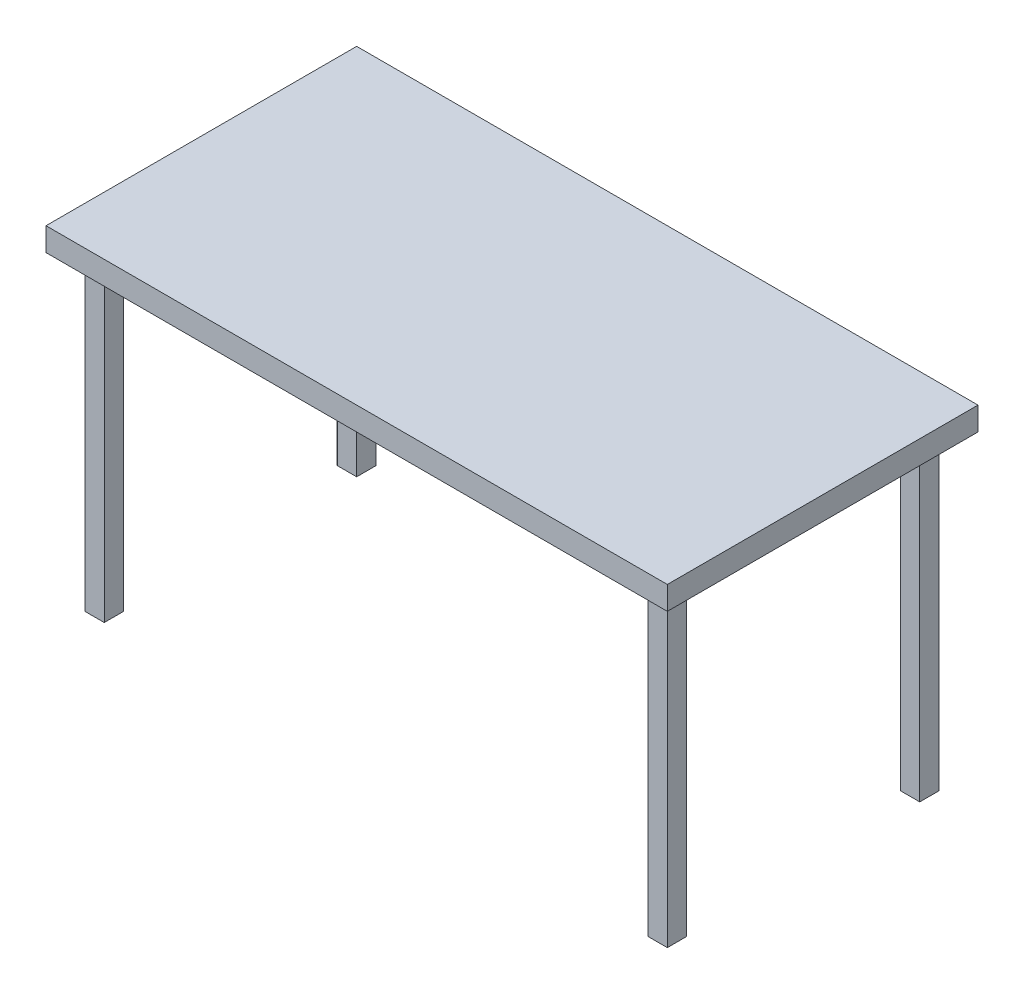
ISO-10303-21;
HEADER;
FILE_DESCRIPTION(('STEP AP214'),'2;1');
FILE_NAME('part.step','',(''),(''),'','','');
FILE_SCHEMA(('AUTOMOTIVE_DESIGN { 1 0 10303 214 1 1 1 1 }'));
ENDSEC;
DATA;
#1=APPLICATION_CONTEXT('core data for automotive mechanical design processes');
#2=APPLICATION_PROTOCOL_DEFINITION('international standard','automotive_design',2000,#1);
#3=PRODUCT_CONTEXT('',#1,'mechanical');
#4=PRODUCT('Part','Part','',(#3));
#5=PRODUCT_RELATED_PRODUCT_CATEGORY('part','',(#4));
#6=PRODUCT_DEFINITION_FORMATION('','',#4);
#7=PRODUCT_DEFINITION_CONTEXT('part definition',#1,'design');
#8=PRODUCT_DEFINITION('design','',#6,#7);
#9=PRODUCT_DEFINITION_SHAPE('','',#8);
#10=(LENGTH_UNIT() NAMED_UNIT(*) SI_UNIT(.MILLI.,.METRE.));
#11=(NAMED_UNIT(*) PLANE_ANGLE_UNIT() SI_UNIT($,.RADIAN.));
#12=(NAMED_UNIT(*) SI_UNIT($,.STERADIAN.) SOLID_ANGLE_UNIT());
#13=UNCERTAINTY_MEASURE_WITH_UNIT(LENGTH_MEASURE(1.E-05),#10,'distance_accuracy_value','');
#14=(GEOMETRIC_REPRESENTATION_CONTEXT(3) GLOBAL_UNCERTAINTY_ASSIGNED_CONTEXT((#13)) GLOBAL_UNIT_ASSIGNED_CONTEXT((#10,
#11,#12)) REPRESENTATION_CONTEXT('',''));
#15=CARTESIAN_POINT('',(0.,0.,0.));
#16=DIRECTION('',(0.,0.,1.));
#17=DIRECTION('',(1.,0.,0.));
#18=AXIS2_PLACEMENT_3D('',#15,#16,#17);
#19=CARTESIAN_POINT('',(0.,0.,0.));
#20=DIRECTION('',(0.,1.,0.));
#21=DIRECTION('',(0.,0.,1.));
#22=AXIS2_PLACEMENT_3D('',#19,#20,#21);
#23=PLANE('',#22);
#24=DIRECTION('',(1.,0.,0.));
#25=VECTOR('',#24,1.);
#26=CARTESIAN_POINT('',(-750.,0.,-300.));
#27=LINE('',#26,#25);
#28=CARTESIAN_POINT('',(-750.,0.,-300.));
#29=VERTEX_POINT('',#28);
#30=CARTESIAN_POINT('',(-700.,0.,-300.));
#31=VERTEX_POINT('',#30);
#32=EDGE_CURVE('E202',#29,#31,#27,.T.);
#33=ORIENTED_EDGE('',*,*,#32,.T.);
#34=DIRECTION('',(0.,0.,-1.));
#35=VECTOR('',#34,1.);
#36=CARTESIAN_POINT('',(-700.,0.,-350.));
#37=LINE('',#36,#35);
#38=CARTESIAN_POINT('',(-700.,0.,-350.));
#39=VERTEX_POINT('',#38);
#40=EDGE_CURVE('E176',#31,#39,#37,.T.);
#41=ORIENTED_EDGE('',*,*,#40,.T.);
#42=DIRECTION('',(-1.,0.,0.));
#43=VECTOR('',#42,1.);
#44=CARTESIAN_POINT('',(-750.,0.,-350.));
#45=LINE('',#44,#43);
#46=CARTESIAN_POINT('',(-750.,0.,-350.));
#47=VERTEX_POINT('',#46);
#48=EDGE_CURVE('E192',#39,#47,#45,.T.);
#49=ORIENTED_EDGE('',*,*,#48,.T.);
#50=DIRECTION('',(0.,0.,1.));
#51=VECTOR('',#50,1.);
#52=CARTESIAN_POINT('',(-750.,0.,-350.));
#53=LINE('',#52,#51);
#54=EDGE_CURVE('E48',#47,#29,#53,.T.);
#55=ORIENTED_EDGE('',*,*,#54,.T.);
#56=EDGE_LOOP('',(#33,#41,#49,#55));
#57=FACE_BOUND('',#56,.T.);
#58=DIRECTION('',(0.,0.,1.));
#59=VECTOR('',#58,1.);
#60=CARTESIAN_POINT('',(-700.,0.,350.));
#61=LINE('',#60,#59);
#62=CARTESIAN_POINT('',(-700.,0.,300.));
#63=VERTEX_POINT('',#62);
#64=CARTESIAN_POINT('',(-700.,0.,350.));
#65=VERTEX_POINT('',#64);
#66=EDGE_CURVE('E273',#63,#65,#61,.T.);
#67=ORIENTED_EDGE('',*,*,#66,.F.);
#68=DIRECTION('',(1.,0.,0.));
#69=VECTOR('',#68,1.);
#70=CARTESIAN_POINT('',(-750.,0.,300.));
#71=LINE('',#70,#69);
#72=CARTESIAN_POINT('',(-750.,0.,300.));
#73=VERTEX_POINT('',#72);
#74=EDGE_CURVE('E278',#73,#63,#71,.T.);
#75=ORIENTED_EDGE('',*,*,#74,.F.);
#76=DIRECTION('',(0.,0.,-1.));
#77=VECTOR('',#76,1.);
#78=CARTESIAN_POINT('',(-750.,0.,350.));
#79=LINE('',#78,#77);
#80=CARTESIAN_POINT('',(-750.,0.,350.));
#81=VERTEX_POINT('',#80);
#82=EDGE_CURVE('E290',#81,#73,#79,.T.);
#83=ORIENTED_EDGE('',*,*,#82,.F.);
#84=DIRECTION('',(-1.,0.,0.));
#85=VECTOR('',#84,1.);
#86=CARTESIAN_POINT('',(-750.,0.,350.));
#87=LINE('',#86,#85);
#88=EDGE_CURVE('E287',#65,#81,#87,.T.);
#89=ORIENTED_EDGE('',*,*,#88,.F.);
#90=EDGE_LOOP('',(#67,#75,#83,#89));
#91=FACE_BOUND('',#90,.T.);
#92=DIRECTION('',(0.,0.,1.));
#93=VECTOR('',#92,1.);
#94=CARTESIAN_POINT('',(-800.,0.,400.));
#95=LINE('',#94,#93);
#96=CARTESIAN_POINT('',(-800.,0.,-400.));
#97=VERTEX_POINT('',#96);
#98=CARTESIAN_POINT('',(-800.,0.,400.));
#99=VERTEX_POINT('',#98);
#100=EDGE_CURVE('E306',#97,#99,#95,.T.);
#101=ORIENTED_EDGE('',*,*,#100,.F.);
#102=DIRECTION('',(-1.,0.,0.));
#103=VECTOR('',#102,1.);
#104=CARTESIAN_POINT('',(800.,0.,-400.));
#105=LINE('',#104,#103);
#106=CARTESIAN_POINT('',(800.,0.,-400.));
#107=VERTEX_POINT('',#106);
#108=EDGE_CURVE('E311',#107,#97,#105,.T.);
#109=ORIENTED_EDGE('',*,*,#108,.F.);
#110=DIRECTION('',(0.,0.,-1.));
#111=VECTOR('',#110,1.);
#112=CARTESIAN_POINT('',(800.,0.,400.));
#113=LINE('',#112,#111);
#114=CARTESIAN_POINT('',(800.,0.,400.));
#115=VERTEX_POINT('',#114);
#116=EDGE_CURVE('E322',#115,#107,#113,.T.);
#117=ORIENTED_EDGE('',*,*,#116,.F.);
#118=DIRECTION('',(1.,0.,0.));
#119=VECTOR('',#118,1.);
#120=CARTESIAN_POINT('',(800.,0.,400.));
#121=LINE('',#120,#119);
#122=EDGE_CURVE('E320',#99,#115,#121,.T.);
#123=ORIENTED_EDGE('',*,*,#122,.F.);
#124=EDGE_LOOP('',(#101,#109,#117,#123));
#125=FACE_BOUND('',#124,.T.);
#126=DIRECTION('',(-1.,0.,0.));
#127=VECTOR('',#126,1.);
#128=CARTESIAN_POINT('',(750.,0.,300.));
#129=LINE('',#128,#127);
#130=CARTESIAN_POINT('',(750.,0.,300.));
#131=VERTEX_POINT('',#130);
#132=CARTESIAN_POINT('',(700.,0.,300.));
#133=VERTEX_POINT('',#132);
#134=EDGE_CURVE('E257',#131,#133,#129,.T.);
#135=ORIENTED_EDGE('',*,*,#134,.T.);
#136=DIRECTION('',(0.,0.,1.));
#137=VECTOR('',#136,1.);
#138=CARTESIAN_POINT('',(700.,0.,350.));
#139=LINE('',#138,#137);
#140=CARTESIAN_POINT('',(700.,0.,350.));
#141=VERTEX_POINT('',#140);
#142=EDGE_CURVE('E240',#133,#141,#139,.T.);
#143=ORIENTED_EDGE('',*,*,#142,.T.);
#144=DIRECTION('',(1.,0.,0.));
#145=VECTOR('',#144,1.);
#146=CARTESIAN_POINT('',(750.,0.,350.));
#147=LINE('',#146,#145);
#148=CARTESIAN_POINT('',(750.,0.,350.));
#149=VERTEX_POINT('',#148);
#150=EDGE_CURVE('E245',#141,#149,#147,.T.);
#151=ORIENTED_EDGE('',*,*,#150,.T.);
#152=DIRECTION('',(0.,0.,-1.));
#153=VECTOR('',#152,1.);
#154=CARTESIAN_POINT('',(750.,0.,350.));
#155=LINE('',#154,#153);
#156=EDGE_CURVE('E260',#149,#131,#155,.T.);
#157=ORIENTED_EDGE('',*,*,#156,.T.);
#158=EDGE_LOOP('',(#135,#143,#151,#157));
#159=FACE_BOUND('',#158,.T.);
#160=DIRECTION('',(0.,0.,-1.));
#161=VECTOR('',#160,1.);
#162=CARTESIAN_POINT('',(700.,0.,-350.));
#163=LINE('',#162,#161);
#164=CARTESIAN_POINT('',(700.,0.,-300.));
#165=VERTEX_POINT('',#164);
#166=CARTESIAN_POINT('',(700.,0.,-350.));
#167=VERTEX_POINT('',#166);
#168=EDGE_CURVE('E181',#165,#167,#163,.T.);
#169=ORIENTED_EDGE('',*,*,#168,.F.);
#170=DIRECTION('',(-1.,0.,0.));
#171=VECTOR('',#170,1.);
#172=CARTESIAN_POINT('',(750.,0.,-300.));
#173=LINE('',#172,#171);
#174=CARTESIAN_POINT('',(750.,0.,-300.));
#175=VERTEX_POINT('',#174);
#176=EDGE_CURVE('E215',#175,#165,#173,.T.);
#177=ORIENTED_EDGE('',*,*,#176,.F.);
#178=DIRECTION('',(0.,0.,1.));
#179=VECTOR('',#178,1.);
#180=CARTESIAN_POINT('',(750.,0.,-350.));
#181=LINE('',#180,#179);
#182=CARTESIAN_POINT('',(750.,0.,-350.));
#183=VERTEX_POINT('',#182);
#184=EDGE_CURVE('E225',#183,#175,#181,.T.);
#185=ORIENTED_EDGE('',*,*,#184,.F.);
#186=DIRECTION('',(1.,0.,0.));
#187=VECTOR('',#186,1.);
#188=CARTESIAN_POINT('',(750.,0.,-350.));
#189=LINE('',#188,#187);
#190=EDGE_CURVE('E56',#167,#183,#189,.T.);
#191=ORIENTED_EDGE('',*,*,#190,.F.);
#192=EDGE_LOOP('',(#169,#177,#185,#191));
#193=FACE_BOUND('',#192,.T.);
#194=ADVANCED_FACE('F33',(#57,#91,#125,#159,#193),#23,.F.);
#195=CARTESIAN_POINT('',(-800.,60.,400.));
#196=DIRECTION('',(1.,0.,0.));
#197=DIRECTION('',(0.,0.,-1.));
#198=AXIS2_PLACEMENT_3D('',#195,#196,#197);
#199=PLANE('',#198);
#200=ORIENTED_EDGE('',*,*,#100,.T.);
#201=DIRECTION('',(0.,-1.,0.));
#202=VECTOR('',#201,1.);
#203=CARTESIAN_POINT('',(-800.,60.,400.));
#204=LINE('',#203,#202);
#205=CARTESIAN_POINT('',(-800.,60.,400.));
#206=VERTEX_POINT('',#205);
#207=EDGE_CURVE('E11',#206,#99,#204,.T.);
#208=ORIENTED_EDGE('',*,*,#207,.F.);
#209=DIRECTION('',(0.,0.,1.));
#210=VECTOR('',#209,1.);
#211=CARTESIAN_POINT('',(-800.,60.,400.));
#212=LINE('',#211,#210);
#213=CARTESIAN_POINT('',(-800.,60.,-400.));
#214=VERTEX_POINT('',#213);
#215=EDGE_CURVE('E307',#214,#206,#212,.T.);
#216=ORIENTED_EDGE('',*,*,#215,.F.);
#217=DIRECTION('',(0.,-1.,0.));
#218=VECTOR('',#217,1.);
#219=CARTESIAN_POINT('',(-800.,60.,-400.));
#220=LINE('',#219,#218);
#221=EDGE_CURVE('E317',#214,#97,#220,.T.);
#222=ORIENTED_EDGE('',*,*,#221,.T.);
#223=EDGE_LOOP('',(#200,#208,#216,#222));
#224=FACE_BOUND('',#223,.T.);
#225=ADVANCED_FACE('F35',(#224),#199,.F.);
#226=CARTESIAN_POINT('',(800.,60.,400.));
#227=DIRECTION('',(0.,0.,-1.));
#228=DIRECTION('',(-1.,0.,0.));
#229=AXIS2_PLACEMENT_3D('',#226,#227,#228);
#230=PLANE('',#229);
#231=ORIENTED_EDGE('',*,*,#122,.T.);
#232=DIRECTION('',(0.,-1.,0.));
#233=VECTOR('',#232,1.);
#234=CARTESIAN_POINT('',(800.,60.,400.));
#235=LINE('',#234,#233);
#236=CARTESIAN_POINT('',(800.,60.,400.));
#237=VERTEX_POINT('',#236);
#238=EDGE_CURVE('E41',#237,#115,#235,.T.);
#239=ORIENTED_EDGE('',*,*,#238,.F.);
#240=DIRECTION('',(1.,0.,0.));
#241=VECTOR('',#240,1.);
#242=CARTESIAN_POINT('',(800.,60.,400.));
#243=LINE('',#242,#241);
#244=EDGE_CURVE('E310',#206,#237,#243,.T.);
#245=ORIENTED_EDGE('',*,*,#244,.F.);
#246=ORIENTED_EDGE('',*,*,#207,.T.);
#247=EDGE_LOOP('',(#231,#239,#245,#246));
#248=FACE_BOUND('',#247,.T.);
#249=ADVANCED_FACE('F350',(#248),#230,.F.);
#250=CARTESIAN_POINT('',(800.,60.,400.));
#251=DIRECTION('',(-1.,0.,0.));
#252=DIRECTION('',(0.,0.,1.));
#253=AXIS2_PLACEMENT_3D('',#250,#251,#252);
#254=PLANE('',#253);
#255=ORIENTED_EDGE('',*,*,#116,.T.);
#256=DIRECTION('',(0.,-1.,0.));
#257=VECTOR('',#256,1.);
#258=CARTESIAN_POINT('',(800.,60.,-400.));
#259=LINE('',#258,#257);
#260=CARTESIAN_POINT('',(800.,60.,-400.));
#261=VERTEX_POINT('',#260);
#262=EDGE_CURVE('E327',#261,#107,#259,.T.);
#263=ORIENTED_EDGE('',*,*,#262,.F.);
#264=DIRECTION('',(0.,0.,-1.));
#265=VECTOR('',#264,1.);
#266=CARTESIAN_POINT('',(800.,60.,400.));
#267=LINE('',#266,#265);
#268=EDGE_CURVE('E313',#237,#261,#267,.T.);
#269=ORIENTED_EDGE('',*,*,#268,.F.);
#270=ORIENTED_EDGE('',*,*,#238,.T.);
#271=EDGE_LOOP('',(#255,#263,#269,#270));
#272=FACE_BOUND('',#271,.T.);
#273=ADVANCED_FACE('F334',(#272),#254,.F.);
#274=CARTESIAN_POINT('',(800.,60.,-400.));
#275=DIRECTION('',(0.,0.,1.));
#276=DIRECTION('',(1.,0.,0.));
#277=AXIS2_PLACEMENT_3D('',#274,#275,#276);
#278=PLANE('',#277);
#279=ORIENTED_EDGE('',*,*,#108,.T.);
#280=ORIENTED_EDGE('',*,*,#221,.F.);
#281=DIRECTION('',(-1.,0.,0.));
#282=VECTOR('',#281,1.);
#283=CARTESIAN_POINT('',(800.,60.,-400.));
#284=LINE('',#283,#282);
#285=EDGE_CURVE('E315',#261,#214,#284,.T.);
#286=ORIENTED_EDGE('',*,*,#285,.F.);
#287=ORIENTED_EDGE('',*,*,#262,.T.);
#288=EDGE_LOOP('',(#279,#280,#286,#287));
#289=FACE_BOUND('',#288,.T.);
#290=ADVANCED_FACE('F343',(#289),#278,.F.);
#291=CARTESIAN_POINT('',(0.,60.,0.));
#292=DIRECTION('',(0.,1.,0.));
#293=DIRECTION('',(0.,0.,1.));
#294=AXIS2_PLACEMENT_3D('',#291,#292,#293);
#295=PLANE('',#294);
#296=ORIENTED_EDGE('',*,*,#215,.T.);
#297=ORIENTED_EDGE('',*,*,#244,.T.);
#298=ORIENTED_EDGE('',*,*,#268,.T.);
#299=ORIENTED_EDGE('',*,*,#285,.T.);
#300=EDGE_LOOP('',(#296,#297,#298,#299));
#301=FACE_BOUND('',#300,.T.);
#302=ADVANCED_FACE('F349',(#301),#295,.T.);
#303=CARTESIAN_POINT('',(-700.,-800.,350.));
#304=DIRECTION('',(-1.,0.,0.));
#305=DIRECTION('',(0.,0.,1.));
#306=AXIS2_PLACEMENT_3D('',#303,#304,#305);
#307=PLANE('',#306);
#308=ORIENTED_EDGE('',*,*,#66,.T.);
#309=DIRECTION('',(0.,1.,0.));
#310=VECTOR('',#309,1.);
#311=CARTESIAN_POINT('',(-700.,-800.,350.));
#312=LINE('',#311,#310);
#313=CARTESIAN_POINT('',(-700.,-800.,350.));
#314=VERTEX_POINT('',#313);
#315=EDGE_CURVE('E303',#314,#65,#312,.T.);
#316=ORIENTED_EDGE('',*,*,#315,.F.);
#317=DIRECTION('',(0.,0.,1.));
#318=VECTOR('',#317,1.);
#319=CARTESIAN_POINT('',(-700.,-800.,350.));
#320=LINE('',#319,#318);
#321=CARTESIAN_POINT('',(-700.,-800.,300.));
#322=VERTEX_POINT('',#321);
#323=EDGE_CURVE('E274',#322,#314,#320,.T.);
#324=ORIENTED_EDGE('',*,*,#323,.F.);
#325=DIRECTION('',(0.,1.,0.));
#326=VECTOR('',#325,1.);
#327=CARTESIAN_POINT('',(-700.,-800.,300.));
#328=LINE('',#327,#326);
#329=EDGE_CURVE('E284',#322,#63,#328,.T.);
#330=ORIENTED_EDGE('',*,*,#329,.T.);
#331=EDGE_LOOP('',(#308,#316,#324,#330));
#332=FACE_BOUND('',#331,.T.);
#333=ADVANCED_FACE('F370',(#332),#307,.F.);
#334=CARTESIAN_POINT('',(-750.,-800.,350.));
#335=DIRECTION('',(0.,0.,-1.));
#336=DIRECTION('',(-1.,0.,0.));
#337=AXIS2_PLACEMENT_3D('',#334,#335,#336);
#338=PLANE('',#337);
#339=ORIENTED_EDGE('',*,*,#88,.T.);
#340=DIRECTION('',(0.,1.,0.));
#341=VECTOR('',#340,1.);
#342=CARTESIAN_POINT('',(-750.,-800.,350.));
#343=LINE('',#342,#341);
#344=CARTESIAN_POINT('',(-750.,-800.,350.));
#345=VERTEX_POINT('',#344);
#346=EDGE_CURVE('E300',#345,#81,#343,.T.);
#347=ORIENTED_EDGE('',*,*,#346,.F.);
#348=DIRECTION('',(-1.,0.,0.));
#349=VECTOR('',#348,1.);
#350=CARTESIAN_POINT('',(-750.,-800.,350.));
#351=LINE('',#350,#349);
#352=EDGE_CURVE('E277',#314,#345,#351,.T.);
#353=ORIENTED_EDGE('',*,*,#352,.F.);
#354=ORIENTED_EDGE('',*,*,#315,.T.);
#355=EDGE_LOOP('',(#339,#347,#353,#354));
#356=FACE_BOUND('',#355,.T.);
#357=ADVANCED_FACE('F374',(#356),#338,.F.);
#358=CARTESIAN_POINT('',(-750.,-800.,350.));
#359=DIRECTION('',(1.,0.,0.));
#360=DIRECTION('',(0.,0.,-1.));
#361=AXIS2_PLACEMENT_3D('',#358,#359,#360);
#362=PLANE('',#361);
#363=ORIENTED_EDGE('',*,*,#82,.T.);
#364=DIRECTION('',(0.,1.,0.));
#365=VECTOR('',#364,1.);
#366=CARTESIAN_POINT('',(-750.,-800.,300.));
#367=LINE('',#366,#365);
#368=CARTESIAN_POINT('',(-750.,-800.,300.));
#369=VERTEX_POINT('',#368);
#370=EDGE_CURVE('E297',#369,#73,#367,.T.);
#371=ORIENTED_EDGE('',*,*,#370,.F.);
#372=DIRECTION('',(0.,0.,-1.));
#373=VECTOR('',#372,1.);
#374=CARTESIAN_POINT('',(-750.,-800.,350.));
#375=LINE('',#374,#373);
#376=EDGE_CURVE('E280',#345,#369,#375,.T.);
#377=ORIENTED_EDGE('',*,*,#376,.F.);
#378=ORIENTED_EDGE('',*,*,#346,.T.);
#379=EDGE_LOOP('',(#363,#371,#377,#378));
#380=FACE_BOUND('',#379,.T.);
#381=ADVANCED_FACE('F379',(#380),#362,.F.);
#382=CARTESIAN_POINT('',(-750.,-800.,300.));
#383=DIRECTION('',(0.,0.,1.));
#384=DIRECTION('',(1.,0.,0.));
#385=AXIS2_PLACEMENT_3D('',#382,#383,#384);
#386=PLANE('',#385);
#387=ORIENTED_EDGE('',*,*,#74,.T.);
#388=ORIENTED_EDGE('',*,*,#329,.F.);
#389=DIRECTION('',(1.,0.,0.));
#390=VECTOR('',#389,1.);
#391=CARTESIAN_POINT('',(-750.,-800.,300.));
#392=LINE('',#391,#390);
#393=EDGE_CURVE('E282',#369,#322,#392,.T.);
#394=ORIENTED_EDGE('',*,*,#393,.F.);
#395=ORIENTED_EDGE('',*,*,#370,.T.);
#396=EDGE_LOOP('',(#387,#388,#394,#395));
#397=FACE_BOUND('',#396,.T.);
#398=ADVANCED_FACE('F385',(#397),#386,.F.);
#399=CARTESIAN_POINT('',(0.,-800.,0.));
#400=DIRECTION('',(0.,-1.,0.));
#401=DIRECTION('',(0.,0.,-1.));
#402=AXIS2_PLACEMENT_3D('',#399,#400,#401);
#403=PLANE('',#402);
#404=ORIENTED_EDGE('',*,*,#323,.T.);
#405=ORIENTED_EDGE('',*,*,#352,.T.);
#406=ORIENTED_EDGE('',*,*,#376,.T.);
#407=ORIENTED_EDGE('',*,*,#393,.T.);
#408=EDGE_LOOP('',(#404,#405,#406,#407));
#409=FACE_BOUND('',#408,.T.);
#410=ADVANCED_FACE('F389',(#409),#403,.T.);
#411=CARTESIAN_POINT('',(700.,-800.,350.));
#412=DIRECTION('',(-1.,0.,0.));
#413=DIRECTION('',(0.,0.,1.));
#414=AXIS2_PLACEMENT_3D('',#411,#412,#413);
#415=PLANE('',#414);
#416=ORIENTED_EDGE('',*,*,#142,.F.);
#417=DIRECTION('',(0.,1.,0.));
#418=VECTOR('',#417,1.);
#419=CARTESIAN_POINT('',(700.,-800.,300.));
#420=LINE('',#419,#418);
#421=CARTESIAN_POINT('',(700.,-800.,300.));
#422=VERTEX_POINT('',#421);
#423=EDGE_CURVE('E271',#422,#133,#420,.T.);
#424=ORIENTED_EDGE('',*,*,#423,.F.);
#425=DIRECTION('',(0.,0.,1.));
#426=VECTOR('',#425,1.);
#427=CARTESIAN_POINT('',(700.,-800.,350.));
#428=LINE('',#427,#426);
#429=CARTESIAN_POINT('',(700.,-800.,350.));
#430=VERTEX_POINT('',#429);
#431=EDGE_CURVE('E241',#422,#430,#428,.T.);
#432=ORIENTED_EDGE('',*,*,#431,.T.);
#433=DIRECTION('',(0.,1.,0.));
#434=VECTOR('',#433,1.);
#435=CARTESIAN_POINT('',(700.,-800.,350.));
#436=LINE('',#435,#434);
#437=EDGE_CURVE('E254',#430,#141,#436,.T.);
#438=ORIENTED_EDGE('',*,*,#437,.T.);
#439=EDGE_LOOP('',(#416,#424,#432,#438));
#440=FACE_BOUND('',#439,.T.);
#441=ADVANCED_FACE('F393',(#440),#415,.T.);
#442=CARTESIAN_POINT('',(750.,-800.,300.));
#443=DIRECTION('',(0.,0.,-1.));
#444=DIRECTION('',(-1.,0.,0.));
#445=AXIS2_PLACEMENT_3D('',#442,#443,#444);
#446=PLANE('',#445);
#447=ORIENTED_EDGE('',*,*,#134,.F.);
#448=DIRECTION('',(0.,1.,0.));
#449=VECTOR('',#448,1.);
#450=CARTESIAN_POINT('',(750.,-800.,300.));
#451=LINE('',#450,#449);
#452=CARTESIAN_POINT('',(750.,-800.,300.));
#453=VERTEX_POINT('',#452);
#454=EDGE_CURVE('E269',#453,#131,#451,.T.);
#455=ORIENTED_EDGE('',*,*,#454,.F.);
#456=DIRECTION('',(-1.,0.,0.));
#457=VECTOR('',#456,1.);
#458=CARTESIAN_POINT('',(750.,-800.,300.));
#459=LINE('',#458,#457);
#460=EDGE_CURVE('E244',#453,#422,#459,.T.);
#461=ORIENTED_EDGE('',*,*,#460,.T.);
#462=ORIENTED_EDGE('',*,*,#423,.T.);
#463=EDGE_LOOP('',(#447,#455,#461,#462));
#464=FACE_BOUND('',#463,.T.);
#465=ADVANCED_FACE('F397',(#464),#446,.T.);
#466=CARTESIAN_POINT('',(750.,-800.,350.));
#467=DIRECTION('',(1.,0.,0.));
#468=DIRECTION('',(0.,0.,-1.));
#469=AXIS2_PLACEMENT_3D('',#466,#467,#468);
#470=PLANE('',#469);
#471=ORIENTED_EDGE('',*,*,#156,.F.);
#472=DIRECTION('',(0.,1.,0.));
#473=VECTOR('',#472,1.);
#474=CARTESIAN_POINT('',(750.,-800.,350.));
#475=LINE('',#474,#473);
#476=CARTESIAN_POINT('',(750.,-800.,350.));
#477=VERTEX_POINT('',#476);
#478=EDGE_CURVE('E266',#477,#149,#475,.T.);
#479=ORIENTED_EDGE('',*,*,#478,.F.);
#480=DIRECTION('',(0.,0.,-1.));
#481=VECTOR('',#480,1.);
#482=CARTESIAN_POINT('',(750.,-800.,350.));
#483=LINE('',#482,#481);
#484=EDGE_CURVE('E248',#477,#453,#483,.T.);
#485=ORIENTED_EDGE('',*,*,#484,.T.);
#486=ORIENTED_EDGE('',*,*,#454,.T.);
#487=EDGE_LOOP('',(#471,#479,#485,#486));
#488=FACE_BOUND('',#487,.T.);
#489=ADVANCED_FACE('F401',(#488),#470,.T.);
#490=CARTESIAN_POINT('',(750.,-800.,350.));
#491=DIRECTION('',(0.,0.,1.));
#492=DIRECTION('',(1.,0.,0.));
#493=AXIS2_PLACEMENT_3D('',#490,#491,#492);
#494=PLANE('',#493);
#495=ORIENTED_EDGE('',*,*,#150,.F.);
#496=ORIENTED_EDGE('',*,*,#437,.F.);
#497=DIRECTION('',(1.,0.,0.));
#498=VECTOR('',#497,1.);
#499=CARTESIAN_POINT('',(750.,-800.,350.));
#500=LINE('',#499,#498);
#501=EDGE_CURVE('E251',#430,#477,#500,.T.);
#502=ORIENTED_EDGE('',*,*,#501,.T.);
#503=ORIENTED_EDGE('',*,*,#478,.T.);
#504=EDGE_LOOP('',(#495,#496,#502,#503));
#505=FACE_BOUND('',#504,.T.);
#506=ADVANCED_FACE('F405',(#505),#494,.T.);
#507=CARTESIAN_POINT('',(0.,-800.,0.));
#508=DIRECTION('',(0.,-1.,0.));
#509=DIRECTION('',(0.,0.,-1.));
#510=AXIS2_PLACEMENT_3D('',#507,#508,#509);
#511=PLANE('',#510);
#512=ORIENTED_EDGE('',*,*,#431,.F.);
#513=ORIENTED_EDGE('',*,*,#460,.F.);
#514=ORIENTED_EDGE('',*,*,#484,.F.);
#515=ORIENTED_EDGE('',*,*,#501,.F.);
#516=EDGE_LOOP('',(#512,#513,#514,#515));
#517=FACE_BOUND('',#516,.T.);
#518=ADVANCED_FACE('F409',(#517),#511,.T.);
#519=CARTESIAN_POINT('',(700.,-800.,-350.));
#520=DIRECTION('',(1.,0.,0.));
#521=DIRECTION('',(0.,0.,-1.));
#522=AXIS2_PLACEMENT_3D('',#519,#520,#521);
#523=PLANE('',#522);
#524=ORIENTED_EDGE('',*,*,#168,.T.);
#525=DIRECTION('',(0.,1.,0.));
#526=VECTOR('',#525,1.);
#527=CARTESIAN_POINT('',(700.,-800.,-350.));
#528=LINE('',#527,#526);
#529=CARTESIAN_POINT('',(700.,-800.,-350.));
#530=VERTEX_POINT('',#529);
#531=EDGE_CURVE('E238',#530,#167,#528,.T.);
#532=ORIENTED_EDGE('',*,*,#531,.F.);
#533=DIRECTION('',(0.,0.,-1.));
#534=VECTOR('',#533,1.);
#535=CARTESIAN_POINT('',(700.,-800.,-350.));
#536=LINE('',#535,#534);
#537=CARTESIAN_POINT('',(700.,-800.,-300.));
#538=VERTEX_POINT('',#537);
#539=EDGE_CURVE('E211',#538,#530,#536,.T.);
#540=ORIENTED_EDGE('',*,*,#539,.F.);
#541=DIRECTION('',(0.,1.,0.));
#542=VECTOR('',#541,1.);
#543=CARTESIAN_POINT('',(700.,-800.,-300.));
#544=LINE('',#543,#542);
#545=EDGE_CURVE('E221',#538,#165,#544,.T.);
#546=ORIENTED_EDGE('',*,*,#545,.T.);
#547=EDGE_LOOP('',(#524,#532,#540,#546));
#548=FACE_BOUND('',#547,.T.);
#549=ADVANCED_FACE('F413',(#548),#523,.F.);
#550=CARTESIAN_POINT('',(750.,-800.,-350.));
#551=DIRECTION('',(0.,0.,1.));
#552=DIRECTION('',(1.,0.,0.));
#553=AXIS2_PLACEMENT_3D('',#550,#551,#552);
#554=PLANE('',#553);
#555=ORIENTED_EDGE('',*,*,#190,.T.);
#556=DIRECTION('',(0.,1.,0.));
#557=VECTOR('',#556,1.);
#558=CARTESIAN_POINT('',(750.,-800.,-350.));
#559=LINE('',#558,#557);
#560=CARTESIAN_POINT('',(750.,-800.,-350.));
#561=VERTEX_POINT('',#560);
#562=EDGE_CURVE('E235',#561,#183,#559,.T.);
#563=ORIENTED_EDGE('',*,*,#562,.F.);
#564=DIRECTION('',(1.,0.,0.));
#565=VECTOR('',#564,1.);
#566=CARTESIAN_POINT('',(750.,-800.,-350.));
#567=LINE('',#566,#565);
#568=EDGE_CURVE('E214',#530,#561,#567,.T.);
#569=ORIENTED_EDGE('',*,*,#568,.F.);
#570=ORIENTED_EDGE('',*,*,#531,.T.);
#571=EDGE_LOOP('',(#555,#563,#569,#570));
#572=FACE_BOUND('',#571,.T.);
#573=ADVANCED_FACE('F417',(#572),#554,.F.);
#574=CARTESIAN_POINT('',(750.,-800.,-350.));
#575=DIRECTION('',(-1.,0.,0.));
#576=DIRECTION('',(0.,0.,1.));
#577=AXIS2_PLACEMENT_3D('',#574,#575,#576);
#578=PLANE('',#577);
#579=ORIENTED_EDGE('',*,*,#184,.T.);
#580=DIRECTION('',(0.,1.,0.));
#581=VECTOR('',#580,1.);
#582=CARTESIAN_POINT('',(750.,-800.,-300.));
#583=LINE('',#582,#581);
#584=CARTESIAN_POINT('',(750.,-800.,-300.));
#585=VERTEX_POINT('',#584);
#586=EDGE_CURVE('E232',#585,#175,#583,.T.);
#587=ORIENTED_EDGE('',*,*,#586,.F.);
#588=DIRECTION('',(0.,0.,1.));
#589=VECTOR('',#588,1.);
#590=CARTESIAN_POINT('',(750.,-800.,-350.));
#591=LINE('',#590,#589);
#592=EDGE_CURVE('E217',#561,#585,#591,.T.);
#593=ORIENTED_EDGE('',*,*,#592,.F.);
#594=ORIENTED_EDGE('',*,*,#562,.T.);
#595=EDGE_LOOP('',(#579,#587,#593,#594));
#596=FACE_BOUND('',#595,.T.);
#597=ADVANCED_FACE('F421',(#596),#578,.F.);
#598=CARTESIAN_POINT('',(750.,-800.,-300.));
#599=DIRECTION('',(0.,0.,-1.));
#600=DIRECTION('',(-1.,0.,0.));
#601=AXIS2_PLACEMENT_3D('',#598,#599,#600);
#602=PLANE('',#601);
#603=ORIENTED_EDGE('',*,*,#176,.T.);
#604=ORIENTED_EDGE('',*,*,#545,.F.);
#605=DIRECTION('',(-1.,0.,0.));
#606=VECTOR('',#605,1.);
#607=CARTESIAN_POINT('',(750.,-800.,-300.));
#608=LINE('',#607,#606);
#609=EDGE_CURVE('E219',#585,#538,#608,.T.);
#610=ORIENTED_EDGE('',*,*,#609,.F.);
#611=ORIENTED_EDGE('',*,*,#586,.T.);
#612=EDGE_LOOP('',(#603,#604,#610,#611));
#613=FACE_BOUND('',#612,.T.);
#614=ADVANCED_FACE('F425',(#613),#602,.F.);
#615=CARTESIAN_POINT('',(0.,-800.,0.));
#616=DIRECTION('',(0.,-1.,0.));
#617=DIRECTION('',(0.,0.,1.));
#618=AXIS2_PLACEMENT_3D('',#615,#616,#617);
#619=PLANE('',#618);
#620=ORIENTED_EDGE('',*,*,#539,.T.);
#621=ORIENTED_EDGE('',*,*,#568,.T.);
#622=ORIENTED_EDGE('',*,*,#592,.T.);
#623=ORIENTED_EDGE('',*,*,#609,.T.);
#624=EDGE_LOOP('',(#620,#621,#622,#623));
#625=FACE_BOUND('',#624,.T.);
#626=ADVANCED_FACE('F429',(#625),#619,.T.);
#627=CARTESIAN_POINT('',(-700.,-800.,-350.));
#628=DIRECTION('',(1.,0.,0.));
#629=DIRECTION('',(0.,0.,-1.));
#630=AXIS2_PLACEMENT_3D('',#627,#628,#629);
#631=PLANE('',#630);
#632=ORIENTED_EDGE('',*,*,#40,.F.);
#633=DIRECTION('',(0.,1.,0.));
#634=VECTOR('',#633,1.);
#635=CARTESIAN_POINT('',(-700.,-800.,-300.));
#636=LINE('',#635,#634);
#637=CARTESIAN_POINT('',(-700.,-800.,-300.));
#638=VERTEX_POINT('',#637);
#639=EDGE_CURVE('E170',#638,#31,#636,.T.);
#640=ORIENTED_EDGE('',*,*,#639,.F.);
#641=DIRECTION('',(0.,0.,-1.));
#642=VECTOR('',#641,1.);
#643=CARTESIAN_POINT('',(-700.,-800.,-350.));
#644=LINE('',#643,#642);
#645=CARTESIAN_POINT('',(-700.,-800.,-350.));
#646=VERTEX_POINT('',#645);
#647=EDGE_CURVE('E173',#638,#646,#644,.T.);
#648=ORIENTED_EDGE('',*,*,#647,.T.);
#649=DIRECTION('',(0.,1.,0.));
#650=VECTOR('',#649,1.);
#651=CARTESIAN_POINT('',(-700.,-800.,-350.));
#652=LINE('',#651,#650);
#653=EDGE_CURVE('E200',#646,#39,#652,.T.);
#654=ORIENTED_EDGE('',*,*,#653,.T.);
#655=EDGE_LOOP('',(#632,#640,#648,#654));
#656=FACE_BOUND('',#655,.T.);
#657=ADVANCED_FACE('F172',(#656),#631,.T.);
#658=CARTESIAN_POINT('',(-750.,-800.,-300.));
#659=DIRECTION('',(0.,0.,1.));
#660=DIRECTION('',(1.,0.,0.));
#661=AXIS2_PLACEMENT_3D('',#658,#659,#660);
#662=PLANE('',#661);
#663=ORIENTED_EDGE('',*,*,#32,.F.);
#664=DIRECTION('',(0.,1.,0.));
#665=VECTOR('',#664,1.);
#666=CARTESIAN_POINT('',(-750.,-800.,-300.));
#667=LINE('',#666,#665);
#668=CARTESIAN_POINT('',(-750.,-800.,-300.));
#669=VERTEX_POINT('',#668);
#670=EDGE_CURVE('E182',#669,#29,#667,.T.);
#671=ORIENTED_EDGE('',*,*,#670,.F.);
#672=DIRECTION('',(1.,0.,0.));
#673=VECTOR('',#672,1.);
#674=CARTESIAN_POINT('',(-750.,-800.,-300.));
#675=LINE('',#674,#673);
#676=EDGE_CURVE('E188',#669,#638,#675,.T.);
#677=ORIENTED_EDGE('',*,*,#676,.T.);
#678=ORIENTED_EDGE('',*,*,#639,.T.);
#679=EDGE_LOOP('',(#663,#671,#677,#678));
#680=FACE_BOUND('',#679,.T.);
#681=ADVANCED_FACE('F194',(#680),#662,.T.);
#682=CARTESIAN_POINT('',(-750.,-800.,-350.));
#683=DIRECTION('',(-1.,0.,0.));
#684=DIRECTION('',(0.,0.,1.));
#685=AXIS2_PLACEMENT_3D('',#682,#683,#684);
#686=PLANE('',#685);
#687=ORIENTED_EDGE('',*,*,#54,.F.);
#688=DIRECTION('',(0.,1.,0.));
#689=VECTOR('',#688,1.);
#690=CARTESIAN_POINT('',(-750.,-800.,-350.));
#691=LINE('',#690,#689);
#692=CARTESIAN_POINT('',(-750.,-800.,-350.));
#693=VERTEX_POINT('',#692);
#694=EDGE_CURVE('E208',#693,#47,#691,.T.);
#695=ORIENTED_EDGE('',*,*,#694,.F.);
#696=DIRECTION('',(0.,0.,1.));
#697=VECTOR('',#696,1.);
#698=CARTESIAN_POINT('',(-750.,-800.,-350.));
#699=LINE('',#698,#697);
#700=EDGE_CURVE('E195',#693,#669,#699,.T.);
#701=ORIENTED_EDGE('',*,*,#700,.T.);
#702=ORIENTED_EDGE('',*,*,#670,.T.);
#703=EDGE_LOOP('',(#687,#695,#701,#702));
#704=FACE_BOUND('',#703,.T.);
#705=ADVANCED_FACE('F438',(#704),#686,.T.);
#706=CARTESIAN_POINT('',(-750.,-800.,-350.));
#707=DIRECTION('',(0.,0.,-1.));
#708=DIRECTION('',(-1.,0.,0.));
#709=AXIS2_PLACEMENT_3D('',#706,#707,#708);
#710=PLANE('',#709);
#711=ORIENTED_EDGE('',*,*,#48,.F.);
#712=ORIENTED_EDGE('',*,*,#653,.F.);
#713=DIRECTION('',(-1.,0.,0.));
#714=VECTOR('',#713,1.);
#715=CARTESIAN_POINT('',(-750.,-800.,-350.));
#716=LINE('',#715,#714);
#717=EDGE_CURVE('E191',#646,#693,#716,.T.);
#718=ORIENTED_EDGE('',*,*,#717,.T.);
#719=ORIENTED_EDGE('',*,*,#694,.T.);
#720=EDGE_LOOP('',(#711,#712,#718,#719));
#721=FACE_BOUND('',#720,.T.);
#722=ADVANCED_FACE('F441',(#721),#710,.T.);
#723=CARTESIAN_POINT('',(0.,-800.,0.));
#724=DIRECTION('',(0.,-1.,0.));
#725=DIRECTION('',(0.,0.,1.));
#726=AXIS2_PLACEMENT_3D('',#723,#724,#725);
#727=PLANE('',#726);
#728=ORIENTED_EDGE('',*,*,#647,.F.);
#729=ORIENTED_EDGE('',*,*,#676,.F.);
#730=ORIENTED_EDGE('',*,*,#700,.F.);
#731=ORIENTED_EDGE('',*,*,#717,.F.);
#732=EDGE_LOOP('',(#728,#729,#730,#731));
#733=FACE_BOUND('',#732,.T.);
#734=ADVANCED_FACE('F186',(#733),#727,.T.);
#735=CLOSED_SHELL('',(#194,#225,#249,#273,#290,#302,#333,#357,#381,#398,#410,#441,#465,#489,
#506,#518,#549,#573,#597,#614,#626,#657,#681,#705,#722,#734));
#736=MANIFOLD_SOLID_BREP('B2',#735);
#737=ADVANCED_BREP_SHAPE_REPRESENTATION('',(#18,#736),#14);
#738=SHAPE_DEFINITION_REPRESENTATION(#9,#737);
ENDSEC;
END-ISO-10303-21;
